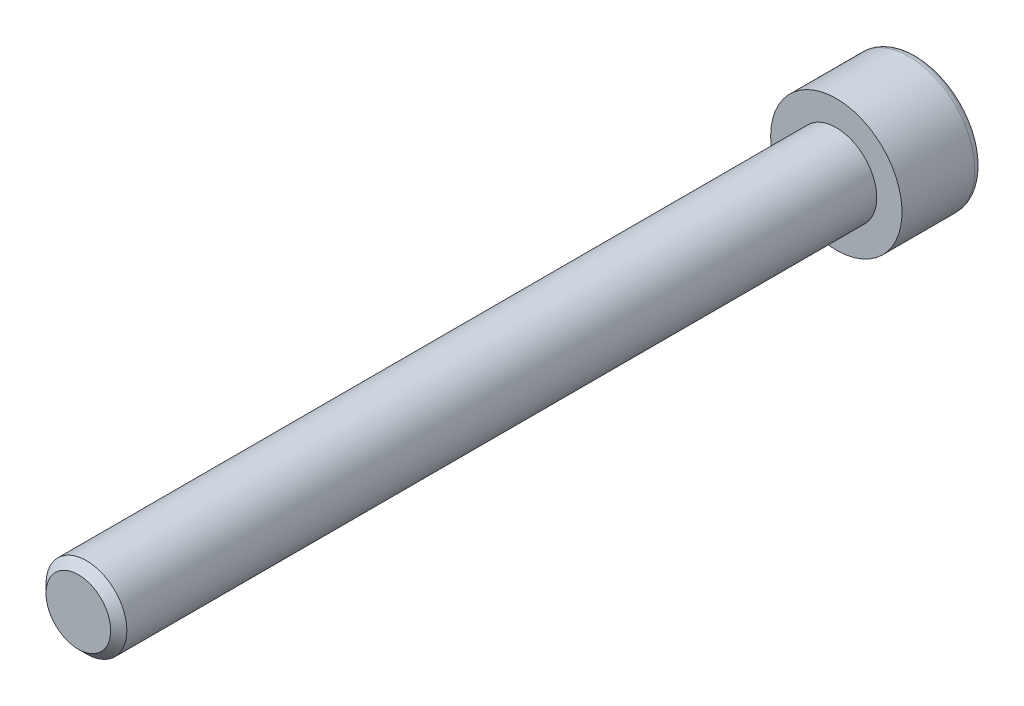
ISO-10303-21;
HEADER;
FILE_DESCRIPTION(('STEP AP214'),'2;1');
FILE_NAME('part.step','',(''),(''),'','','');
FILE_SCHEMA(('AUTOMOTIVE_DESIGN { 1 0 10303 214 1 1 1 1 }'));
ENDSEC;
DATA;
#1=APPLICATION_CONTEXT('core data for automotive mechanical design processes');
#2=APPLICATION_PROTOCOL_DEFINITION('international standard','automotive_design',2000,#1);
#3=PRODUCT_CONTEXT('',#1,'mechanical');
#4=PRODUCT('Part','Part','',(#3));
#5=PRODUCT_RELATED_PRODUCT_CATEGORY('part','',(#4));
#6=PRODUCT_DEFINITION_FORMATION('','',#4);
#7=PRODUCT_DEFINITION_CONTEXT('part definition',#1,'design');
#8=PRODUCT_DEFINITION('design','',#6,#7);
#9=PRODUCT_DEFINITION_SHAPE('','',#8);
#10=(LENGTH_UNIT() NAMED_UNIT(*) SI_UNIT(.MILLI.,.METRE.));
#11=(NAMED_UNIT(*) PLANE_ANGLE_UNIT() SI_UNIT($,.RADIAN.));
#12=(NAMED_UNIT(*) SI_UNIT($,.STERADIAN.) SOLID_ANGLE_UNIT());
#13=UNCERTAINTY_MEASURE_WITH_UNIT(LENGTH_MEASURE(1.E-05),#10,'distance_accuracy_value','');
#14=(GEOMETRIC_REPRESENTATION_CONTEXT(3) GLOBAL_UNCERTAINTY_ASSIGNED_CONTEXT((#13)) GLOBAL_UNIT_ASSIGNED_CONTEXT((#10,
#11,#12)) REPRESENTATION_CONTEXT('',''));
#15=CARTESIAN_POINT('',(0.,0.,0.));
#16=DIRECTION('',(0.,0.,1.));
#17=DIRECTION('',(1.,0.,0.));
#18=AXIS2_PLACEMENT_3D('',#15,#16,#17);
#19=CARTESIAN_POINT('',(0.,0.,-8.));
#20=DIRECTION('',(0.,0.,1.));
#21=DIRECTION('',(1.,0.,0.));
#22=AXIS2_PLACEMENT_3D('',#19,#20,#21);
#23=PLANE('',#22);
#24=CARTESIAN_POINT('',(0.,0.,-8.));
#25=DIRECTION('',(0.,0.,-1.));
#26=DIRECTION('',(-1.,0.,0.));
#27=AXIS2_PLACEMENT_3D('',#24,#25,#26);
#28=CIRCLE('',#27,5.7);
#29=CARTESIAN_POINT('',(-5.7,0.,-8.));
#30=VERTEX_POINT('',#29);
#31=EDGE_CURVE('E147',#30,#30,#28,.T.);
#32=ORIENTED_EDGE('',*,*,#31,.T.);
#33=EDGE_LOOP('',(#32));
#34=FACE_BOUND('',#33,.T.);
#35=DIRECTION('',(-0.86602540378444,0.499999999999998,0.));
#36=VECTOR('',#35,1.);
#37=CARTESIAN_POINT('',(0.,3.46410161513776,-8.));
#38=LINE('',#37,#36);
#39=CARTESIAN_POINT('',(3.,1.73205080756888,-8.));
#40=VERTEX_POINT('',#39);
#41=CARTESIAN_POINT('',(0.,3.46410161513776,-8.));
#42=VERTEX_POINT('',#41);
#43=EDGE_CURVE('E49',#40,#42,#38,.T.);
#44=ORIENTED_EDGE('',*,*,#43,.T.);
#45=DIRECTION('',(-0.866025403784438,-0.500000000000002,0.));
#46=VECTOR('',#45,1.);
#47=CARTESIAN_POINT('',(0.,3.46410161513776,-8.));
#48=LINE('',#47,#46);
#49=CARTESIAN_POINT('',(-3.,1.73205080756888,-8.));
#50=VERTEX_POINT('',#49);
#51=EDGE_CURVE('E120',#42,#50,#48,.T.);
#52=ORIENTED_EDGE('',*,*,#51,.T.);
#53=DIRECTION('',(0.,-1.,0.));
#54=VECTOR('',#53,1.);
#55=CARTESIAN_POINT('',(-3.,-1.73205080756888,-8.));
#56=LINE('',#55,#54);
#57=CARTESIAN_POINT('',(-3.,-1.73205080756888,-8.));
#58=VERTEX_POINT('',#57);
#59=EDGE_CURVE('E124',#50,#58,#56,.T.);
#60=ORIENTED_EDGE('',*,*,#59,.T.);
#61=DIRECTION('',(0.866025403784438,-0.500000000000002,0.));
#62=VECTOR('',#61,1.);
#63=CARTESIAN_POINT('',(0.,-3.46410161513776,-8.));
#64=LINE('',#63,#62);
#65=CARTESIAN_POINT('',(0.,-3.46410161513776,-8.));
#66=VERTEX_POINT('',#65);
#67=EDGE_CURVE('E127',#58,#66,#64,.T.);
#68=ORIENTED_EDGE('',*,*,#67,.T.);
#69=DIRECTION('',(0.86602540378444,0.499999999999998,0.));
#70=VECTOR('',#69,1.);
#71=CARTESIAN_POINT('',(0.,-3.46410161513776,-8.));
#72=LINE('',#71,#70);
#73=CARTESIAN_POINT('',(3.,-1.73205080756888,-8.));
#74=VERTEX_POINT('',#73);
#75=EDGE_CURVE('E110',#66,#74,#72,.T.);
#76=ORIENTED_EDGE('',*,*,#75,.T.);
#77=DIRECTION('',(0.,1.,0.));
#78=VECTOR('',#77,1.);
#79=CARTESIAN_POINT('',(3.,-1.73205080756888,-8.));
#80=LINE('',#79,#78);
#81=EDGE_CURVE('E130',#74,#40,#80,.T.);
#82=ORIENTED_EDGE('',*,*,#81,.T.);
#83=EDGE_LOOP('',(#44,#52,#60,#68,#76,#82));
#84=FACE_BOUND('',#83,.T.);
#85=ADVANCED_FACE('F34',(#34,#84),#23,.F.);
#86=CARTESIAN_POINT('',(0.,0.,-7.2));
#87=DIRECTION('',(0.,0.,-1.));
#88=DIRECTION('',(-1.,0.,0.));
#89=AXIS2_PLACEMENT_3D('',#86,#87,#88);
#90=TOROIDAL_SURFACE('',#89,5.7,0.8);
#91=ORIENTED_EDGE('',*,*,#31,.F.);
#92=EDGE_LOOP('',(#91));
#93=FACE_BOUND('',#92,.T.);
#94=CARTESIAN_POINT('',(0.,0.,-7.2));
#95=DIRECTION('',(0.,0.,-1.));
#96=DIRECTION('',(-1.,0.,0.));
#97=AXIS2_PLACEMENT_3D('',#94,#95,#96);
#98=CIRCLE('',#97,6.5);
#99=CARTESIAN_POINT('',(-6.5,0.,-7.2));
#100=VERTEX_POINT('',#99);
#101=EDGE_CURVE('E144',#100,#100,#98,.T.);
#102=ORIENTED_EDGE('',*,*,#101,.T.);
#103=EDGE_LOOP('',(#102));
#104=FACE_BOUND('',#103,.T.);
#105=ADVANCED_FACE('F164',(#93,#104),#90,.T.);
#106=CARTESIAN_POINT('',(0.,0.,0.));
#107=DIRECTION('',(0.,0.,-1.));
#108=DIRECTION('',(-1.,0.,0.));
#109=AXIS2_PLACEMENT_3D('',#106,#107,#108);
#110=CYLINDRICAL_SURFACE('',#109,6.5);
#111=ORIENTED_EDGE('',*,*,#101,.F.);
#112=EDGE_LOOP('',(#111));
#113=FACE_BOUND('',#112,.T.);
#114=CARTESIAN_POINT('',(0.,0.,0.));
#115=DIRECTION('',(0.,0.,-1.));
#116=DIRECTION('',(-1.,0.,0.));
#117=AXIS2_PLACEMENT_3D('',#114,#115,#116);
#118=CIRCLE('',#117,6.5);
#119=CARTESIAN_POINT('',(-6.5,0.,0.));
#120=VERTEX_POINT('',#119);
#121=EDGE_CURVE('E141',#120,#120,#118,.T.);
#122=ORIENTED_EDGE('',*,*,#121,.T.);
#123=EDGE_LOOP('',(#122));
#124=FACE_BOUND('',#123,.T.);
#125=ADVANCED_FACE('F169',(#113,#124),#110,.T.);
#126=CARTESIAN_POINT('',(0.,0.,0.));
#127=DIRECTION('',(0.,0.,-1.));
#128=DIRECTION('',(-1.,0.,0.));
#129=AXIS2_PLACEMENT_3D('',#126,#127,#128);
#130=PLANE('',#129);
#131=CARTESIAN_POINT('',(0.,0.,0.));
#132=DIRECTION('',(0.,0.,1.));
#133=DIRECTION('',(1.,0.,0.));
#134=AXIS2_PLACEMENT_3D('',#131,#132,#133);
#135=CIRCLE('',#134,4.);
#136=CARTESIAN_POINT('',(4.,0.,0.));
#137=VERTEX_POINT('',#136);
#138=EDGE_CURVE('E121',#137,#137,#135,.T.);
#139=ORIENTED_EDGE('',*,*,#138,.F.);
#140=EDGE_LOOP('',(#139));
#141=FACE_BOUND('',#140,.T.);
#142=ORIENTED_EDGE('',*,*,#121,.F.);
#143=EDGE_LOOP('',(#142));
#144=FACE_BOUND('',#143,.T.);
#145=ADVANCED_FACE('F176',(#141,#144),#130,.F.);
#146=CARTESIAN_POINT('',(0.,3.46410161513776,-4.));
#147=DIRECTION('',(-0.499999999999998,-0.86602540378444,0.));
#148=DIRECTION('',(0.86602540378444,-0.499999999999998,0.));
#149=AXIS2_PLACEMENT_3D('',#146,#147,#148);
#150=PLANE('',#149);
#151=ORIENTED_EDGE('',*,*,#43,.F.);
#152=DIRECTION('',(0.,0.,-1.));
#153=VECTOR('',#152,1.);
#154=CARTESIAN_POINT('',(3.,1.73205080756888,-4.));
#155=LINE('',#154,#153);
#156=CARTESIAN_POINT('',(3.,1.73205080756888,-4.));
#157=VERTEX_POINT('',#156);
#158=EDGE_CURVE('E115',#157,#40,#155,.T.);
#159=ORIENTED_EDGE('',*,*,#158,.F.);
#160=DIRECTION('',(-0.86602540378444,0.499999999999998,0.));
#161=VECTOR('',#160,1.);
#162=CARTESIAN_POINT('',(0.,3.46410161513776,-4.));
#163=LINE('',#162,#161);
#164=CARTESIAN_POINT('',(0.,3.46410161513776,-4.));
#165=VERTEX_POINT('',#164);
#166=EDGE_CURVE('E133',#157,#165,#163,.T.);
#167=ORIENTED_EDGE('',*,*,#166,.T.);
#168=DIRECTION('',(0.,0.,-1.));
#169=VECTOR('',#168,1.);
#170=CARTESIAN_POINT('',(0.,3.46410161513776,-4.));
#171=LINE('',#170,#169);
#172=EDGE_CURVE('E139',#165,#42,#171,.T.);
#173=ORIENTED_EDGE('',*,*,#172,.T.);
#174=EDGE_LOOP('',(#151,#159,#167,#173));
#175=FACE_BOUND('',#174,.T.);
#176=ADVANCED_FACE('F180',(#175),#150,.T.);
#177=CARTESIAN_POINT('',(0.,3.46410161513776,-4.));
#178=DIRECTION('',(0.500000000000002,-0.866025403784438,0.));
#179=DIRECTION('',(0.866025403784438,0.500000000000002,0.));
#180=AXIS2_PLACEMENT_3D('',#177,#178,#179);
#181=PLANE('',#180);
#182=ORIENTED_EDGE('',*,*,#51,.F.);
#183=ORIENTED_EDGE('',*,*,#172,.F.);
#184=DIRECTION('',(-0.866025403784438,-0.500000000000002,0.));
#185=VECTOR('',#184,1.);
#186=CARTESIAN_POINT('',(0.,3.46410161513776,-4.));
#187=LINE('',#186,#185);
#188=CARTESIAN_POINT('',(-3.,1.73205080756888,-4.));
#189=VERTEX_POINT('',#188);
#190=EDGE_CURVE('E88',#165,#189,#187,.T.);
#191=ORIENTED_EDGE('',*,*,#190,.T.);
#192=DIRECTION('',(0.,0.,-1.));
#193=VECTOR('',#192,1.);
#194=CARTESIAN_POINT('',(-3.,1.73205080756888,-4.));
#195=LINE('',#194,#193);
#196=EDGE_CURVE('E137',#189,#50,#195,.T.);
#197=ORIENTED_EDGE('',*,*,#196,.T.);
#198=EDGE_LOOP('',(#182,#183,#191,#197));
#199=FACE_BOUND('',#198,.T.);
#200=ADVANCED_FACE('F184',(#199),#181,.T.);
#201=CARTESIAN_POINT('',(-3.,-1.73205080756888,-4.));
#202=DIRECTION('',(1.,0.,0.));
#203=DIRECTION('',(0.,0.,-1.));
#204=AXIS2_PLACEMENT_3D('',#201,#202,#203);
#205=PLANE('',#204);
#206=ORIENTED_EDGE('',*,*,#59,.F.);
#207=ORIENTED_EDGE('',*,*,#196,.F.);
#208=DIRECTION('',(0.,-1.,0.));
#209=VECTOR('',#208,1.);
#210=CARTESIAN_POINT('',(-3.,-1.73205080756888,-4.));
#211=LINE('',#210,#209);
#212=CARTESIAN_POINT('',(-3.,-1.73205080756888,-4.));
#213=VERTEX_POINT('',#212);
#214=EDGE_CURVE('E106',#189,#213,#211,.T.);
#215=ORIENTED_EDGE('',*,*,#214,.T.);
#216=DIRECTION('',(0.,0.,-1.));
#217=VECTOR('',#216,1.);
#218=CARTESIAN_POINT('',(-3.,-1.73205080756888,-4.));
#219=LINE('',#218,#217);
#220=EDGE_CURVE('E103',#213,#58,#219,.T.);
#221=ORIENTED_EDGE('',*,*,#220,.T.);
#222=EDGE_LOOP('',(#206,#207,#215,#221));
#223=FACE_BOUND('',#222,.T.);
#224=ADVANCED_FACE('F187',(#223),#205,.T.);
#225=CARTESIAN_POINT('',(0.,-3.46410161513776,-4.));
#226=DIRECTION('',(0.500000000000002,0.866025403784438,0.));
#227=DIRECTION('',(-0.866025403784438,0.500000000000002,0.));
#228=AXIS2_PLACEMENT_3D('',#225,#226,#227);
#229=PLANE('',#228);
#230=ORIENTED_EDGE('',*,*,#67,.F.);
#231=ORIENTED_EDGE('',*,*,#220,.F.);
#232=DIRECTION('',(0.866025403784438,-0.500000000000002,0.));
#233=VECTOR('',#232,1.);
#234=CARTESIAN_POINT('',(0.,-3.46410161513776,-4.));
#235=LINE('',#234,#233);
#236=CARTESIAN_POINT('',(0.,-3.46410161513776,-4.));
#237=VERTEX_POINT('',#236);
#238=EDGE_CURVE('E98',#213,#237,#235,.T.);
#239=ORIENTED_EDGE('',*,*,#238,.T.);
#240=DIRECTION('',(0.,0.,-1.));
#241=VECTOR('',#240,1.);
#242=CARTESIAN_POINT('',(0.,-3.46410161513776,-4.));
#243=LINE('',#242,#241);
#244=EDGE_CURVE('E102',#237,#66,#243,.T.);
#245=ORIENTED_EDGE('',*,*,#244,.T.);
#246=EDGE_LOOP('',(#230,#231,#239,#245));
#247=FACE_BOUND('',#246,.T.);
#248=ADVANCED_FACE('F101',(#247),#229,.T.);
#249=CARTESIAN_POINT('',(0.,-3.46410161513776,-4.));
#250=DIRECTION('',(-0.499999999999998,0.86602540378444,0.));
#251=DIRECTION('',(-0.86602540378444,-0.499999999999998,0.));
#252=AXIS2_PLACEMENT_3D('',#249,#250,#251);
#253=PLANE('',#252);
#254=ORIENTED_EDGE('',*,*,#75,.F.);
#255=ORIENTED_EDGE('',*,*,#244,.F.);
#256=DIRECTION('',(0.86602540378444,0.499999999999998,0.));
#257=VECTOR('',#256,1.);
#258=CARTESIAN_POINT('',(0.,-3.46410161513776,-4.));
#259=LINE('',#258,#257);
#260=CARTESIAN_POINT('',(3.,-1.73205080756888,-4.));
#261=VERTEX_POINT('',#260);
#262=EDGE_CURVE('E105',#237,#261,#259,.T.);
#263=ORIENTED_EDGE('',*,*,#262,.T.);
#264=DIRECTION('',(0.,0.,-1.));
#265=VECTOR('',#264,1.);
#266=CARTESIAN_POINT('',(3.,-1.73205080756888,-4.));
#267=LINE('',#266,#265);
#268=EDGE_CURVE('E79',#261,#74,#267,.T.);
#269=ORIENTED_EDGE('',*,*,#268,.T.);
#270=EDGE_LOOP('',(#254,#255,#263,#269));
#271=FACE_BOUND('',#270,.T.);
#272=ADVANCED_FACE('F108',(#271),#253,.T.);
#273=CARTESIAN_POINT('',(3.,-1.73205080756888,-4.));
#274=DIRECTION('',(-1.,0.,0.));
#275=DIRECTION('',(0.,0.,1.));
#276=AXIS2_PLACEMENT_3D('',#273,#274,#275);
#277=PLANE('',#276);
#278=ORIENTED_EDGE('',*,*,#81,.F.);
#279=ORIENTED_EDGE('',*,*,#268,.F.);
#280=DIRECTION('',(0.,1.,0.));
#281=VECTOR('',#280,1.);
#282=CARTESIAN_POINT('',(3.,-1.73205080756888,-4.));
#283=LINE('',#282,#281);
#284=EDGE_CURVE('E57',#261,#157,#283,.T.);
#285=ORIENTED_EDGE('',*,*,#284,.T.);
#286=ORIENTED_EDGE('',*,*,#158,.T.);
#287=EDGE_LOOP('',(#278,#279,#285,#286));
#288=FACE_BOUND('',#287,.T.);
#289=ADVANCED_FACE('F196',(#288),#277,.T.);
#290=CARTESIAN_POINT('',(3.,1.73205080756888,-4.));
#291=DIRECTION('',(0.,0.,1.));
#292=DIRECTION('',(1.,0.,0.));
#293=AXIS2_PLACEMENT_3D('',#290,#291,#292);
#294=PLANE('',#293);
#295=ORIENTED_EDGE('',*,*,#166,.F.);
#296=ORIENTED_EDGE('',*,*,#284,.F.);
#297=ORIENTED_EDGE('',*,*,#262,.F.);
#298=ORIENTED_EDGE('',*,*,#238,.F.);
#299=ORIENTED_EDGE('',*,*,#214,.F.);
#300=ORIENTED_EDGE('',*,*,#190,.F.);
#301=EDGE_LOOP('',(#295,#296,#297,#298,#299,#300));
#302=FACE_BOUND('',#301,.T.);
#303=ADVANCED_FACE('F113',(#302),#294,.F.);
#304=CARTESIAN_POINT('',(0.,0.,75.));
#305=DIRECTION('',(0.,0.,1.));
#306=DIRECTION('',(1.,0.,0.));
#307=AXIS2_PLACEMENT_3D('',#304,#305,#306);
#308=PLANE('',#307);
#309=CARTESIAN_POINT('',(0.,0.,75.));
#310=DIRECTION('',(0.,0.,1.));
#311=DIRECTION('',(1.,0.,0.));
#312=AXIS2_PLACEMENT_3D('',#309,#310,#311);
#313=CIRCLE('',#312,3.20000000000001);
#314=CARTESIAN_POINT('',(3.20000000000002,0.,75.));
#315=VERTEX_POINT('',#314);
#316=EDGE_CURVE('E42',#315,#315,#313,.T.);
#317=ORIENTED_EDGE('',*,*,#316,.T.);
#318=EDGE_LOOP('',(#317));
#319=FACE_BOUND('',#318,.T.);
#320=ADVANCED_FACE('F152',(#319),#308,.T.);
#321=CARTESIAN_POINT('',(0.,0.,0.));
#322=DIRECTION('',(0.,0.,1.));
#323=DIRECTION('',(1.,0.,0.));
#324=AXIS2_PLACEMENT_3D('',#321,#322,#323);
#325=CYLINDRICAL_SURFACE('',#324,4.);
#326=CARTESIAN_POINT('',(0.,0.,74.2));
#327=DIRECTION('',(0.,0.,1.));
#328=DIRECTION('',(1.,0.,0.));
#329=AXIS2_PLACEMENT_3D('',#326,#327,#328);
#330=CIRCLE('',#329,4.);
#331=CARTESIAN_POINT('',(4.00000000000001,0.,74.2));
#332=VERTEX_POINT('',#331);
#333=EDGE_CURVE('E11',#332,#332,#330,.F.);
#334=ORIENTED_EDGE('',*,*,#333,.T.);
#335=EDGE_LOOP('',(#334));
#336=FACE_BOUND('',#335,.T.);
#337=ORIENTED_EDGE('',*,*,#138,.T.);
#338=EDGE_LOOP('',(#337));
#339=FACE_BOUND('',#338,.T.);
#340=ADVANCED_FACE('F155',(#336,#339),#325,.T.);
#341=CARTESIAN_POINT('',(0.,0.,75.));
#342=DIRECTION('',(0.,0.,-1.));
#343=DIRECTION('',(-1.,0.,0.));
#344=AXIS2_PLACEMENT_3D('',#341,#342,#343);
#345=CONICAL_SURFACE('',#344,3.20000000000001,0.785398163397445);
#346=ORIENTED_EDGE('',*,*,#333,.F.);
#347=EDGE_LOOP('',(#346));
#348=FACE_BOUND('',#347,.T.);
#349=ORIENTED_EDGE('',*,*,#316,.F.);
#350=EDGE_LOOP('',(#349));
#351=FACE_BOUND('',#350,.T.);
#352=ADVANCED_FACE('F36',(#348,#351),#345,.T.);
#353=CLOSED_SHELL('',(#85,#105,#125,#145,#176,#200,#224,#248,#272,#289,#303,#320,#340,#352));
#354=MANIFOLD_SOLID_BREP('B2',#353);
#355=ADVANCED_BREP_SHAPE_REPRESENTATION('',(#18,#354),#14);
#356=SHAPE_DEFINITION_REPRESENTATION(#9,#355);
ENDSEC;
END-ISO-10303-21;
